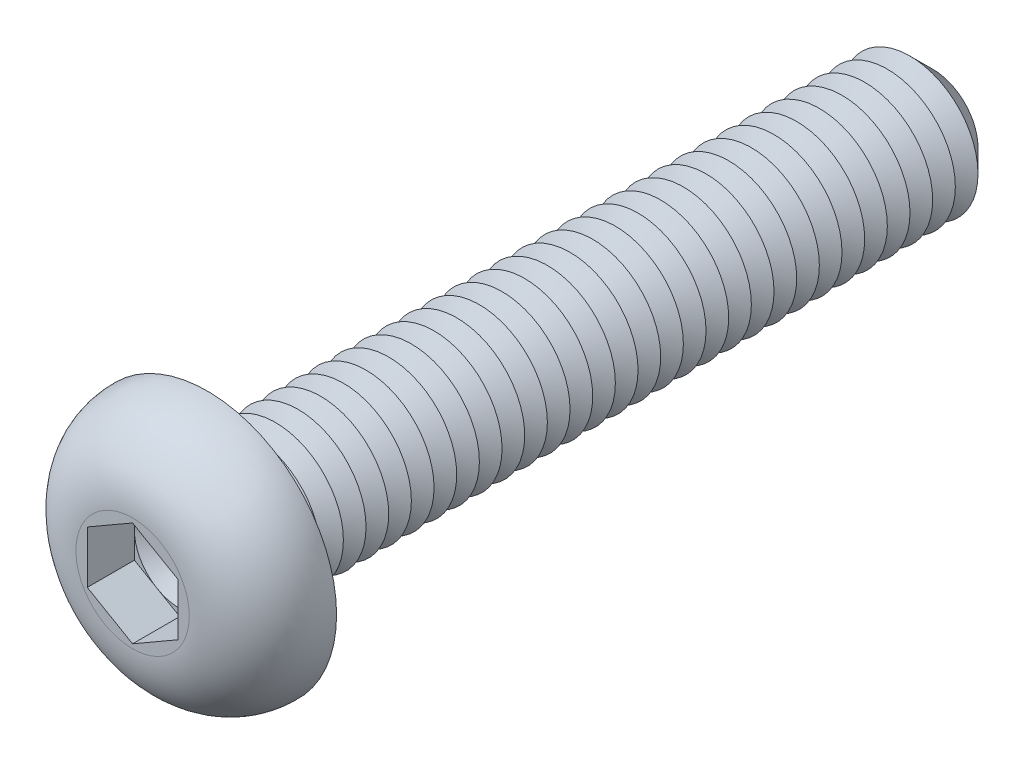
from build123d import *

# Parameters (mm, degrees)
CUT_EXTRUDE1_DEPTH  = 1.04
SKETCH4_R           = 1.5
BOSS_EXTRUDE1_DEPTH = 16
CHAMFER1_SIZE       = 0.5
LPATTERN1_COUNT     = 30
LPATTERN1_PITCH     = 0.5
FILLET2_R           = 0.2


with BuildPart() as part:
    # Sketch2 → Revolve1 (revolve)
    with BuildSketch(Plane(origin=(0, 0, 0), x_dir=(0, 0, -1), z_dir=(1, 0, 0)), mode=Mode.PRIVATE) as revolve1_sk:
        with BuildLine():
            Line((0, 0), (-1.65, 0))
            Line((-1.65, 0), (-1.65, 1.250781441))
            ThreePointArc((-1.65, 1.250781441), (-1.163552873, 2.39969397), (0, 2.85))
            Line((0, 2.85), (0, 0))
        make_face()
    revolve(revolve1_sk.sketch.rotate(Axis((0, 0, 47.934239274), (0, 0, -1)), 90), axis=Axis((0, 0, 47.934239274), (0, 0, -1)))

    # Sketch3 → Cut-Extrude1 (cut)
    with BuildSketch(Plane.XY.offset(1.65)):
        Polygon((0, 1.154700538), (-1, 0.577350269), (-1, -0.577350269), (0, -1.154700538), (1, -0.577350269), (1, 0.577350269), align=None)
    extrude(amount=-CUT_EXTRUDE1_DEPTH, mode=Mode.SUBTRACT)

    # Sketch4 → Boss-Extrude1 (add)
    with BuildSketch(Plane(origin=(0, 0, 0), x_dir=(-1, 0, 0), z_dir=(0, 0, -1))):
        with Locations(Location((0, 0, 0), (0, 0, 180))):
            Circle(SKETCH4_R)
    extrude(amount=BOSS_EXTRUDE1_DEPTH)

    # Chamfer1
    chamfer1_edges = [part.edges().sort_by_distance(p)[0] for p in [
        (-1.5, 0, -16),
    ]]
    chamfer(chamfer1_edges, length=CHAMFER1_SIZE)

    # Sketch5 → Cut-Revolve1 (revolve, cut)
    with BuildSketch(Plane(origin=(0, 0, 0), x_dir=(0, 0, -1), z_dir=(1, 0, 0)), mode=Mode.PRIVATE) as cut_revolve1_sk:
        Polygon((0.5, 1.5), (1, 1.5), (0.75, 1.066987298), align=None)
    cut_revolve1 = revolve(cut_revolve1_sk.sketch.rotate(Axis((0, 0, 47.934239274), (0, 0, -1)), 90), axis=Axis((0, 0, 47.934239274), (0, 0, -1)), mode=Mode.SUBTRACT)

    # LPattern1: Cut-Revolve1 ×30
    with Locations(*[(0, 0, -i * LPATTERN1_PITCH) for i in range(1, LPATTERN1_COUNT)]):
        add(cut_revolve1, mode=Mode.SUBTRACT)

    # Fillet2
    fillet2_edges = [part.edges().sort_by_distance(p)[0] for p in [
        (-1.5, 0, 0),
    ]]
    fillet(fillet2_edges, radius=FILLET2_R)

    # Cut-Extrude2 cone 1 section (on through the dimple's axis) → Cut-Extrude2 (revolve, cut)
    with BuildSketch(Plane(origin=(0, 0, 0.61), x_dir=(0, -1, 0), z_dir=(1, 0, 0))):
        Polygon((0, 0), (1, 0), (0, 0.577350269), align=None)
    revolve(axis=Axis((0, 0, 0.61), (0, 0, -1)), mode=Mode.SUBTRACT)


solid = part.part
